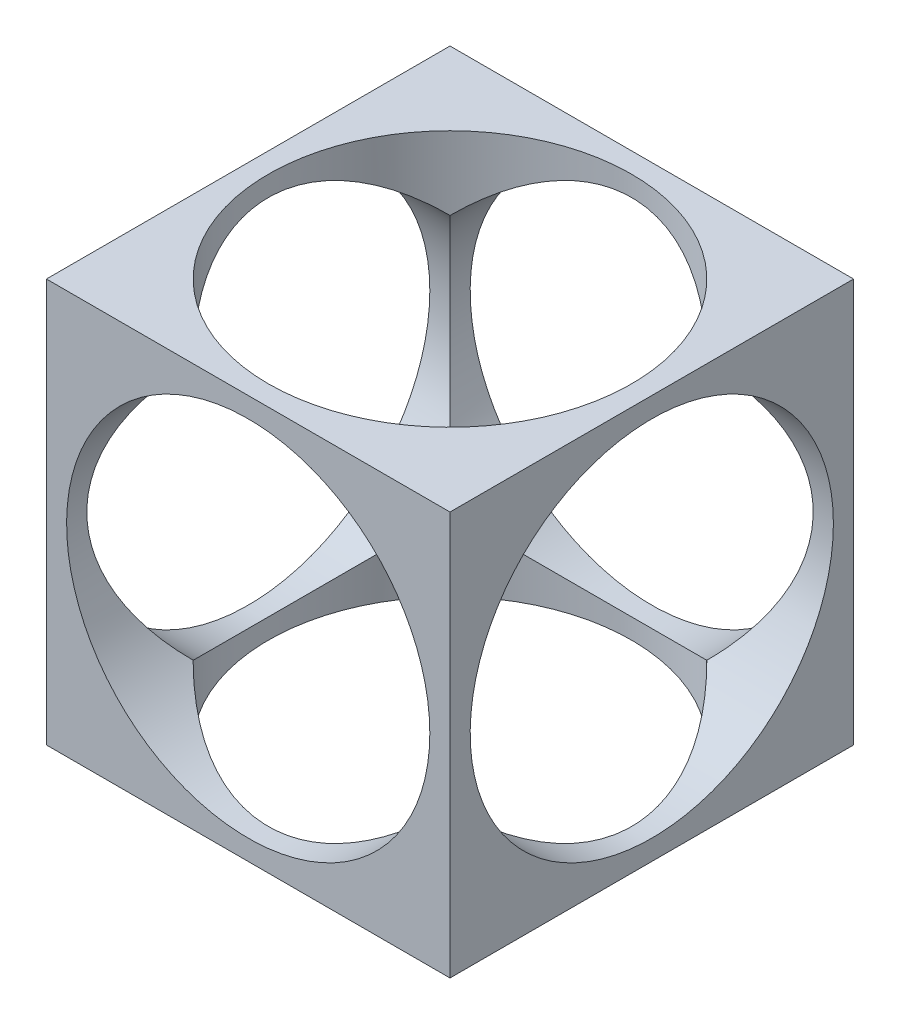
from build123d import *

# Parameters (mm, degrees)
SKETCH1_W          = 100
SKETCH1_H          = 100
EXTRUDE1_DEPTH     = 100
SKETCH2_R          = 45
CUT_EXTRUDE1_DEPTH = 174.205080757
SKETCH4_R          = 45
CUT_EXTRUDE2_DEPTH = 174.205080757
SKETCH5_R          = 45
CUT_EXTRUDE3_DEPTH = 174.205080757


with BuildPart() as part:
    # Sketch1 → Extrude1 (new body)
    with BuildSketch(Plane.XY):
        with Locations((50, 50)):
            Rectangle(SKETCH1_W, SKETCH1_H)
    extrude(amount=EXTRUDE1_DEPTH)

    # Sketch2 → Cut-Extrude1 (cut, through all)
    with BuildSketch(Plane(origin=(0, 0, 0), x_dir=(0, 0, -1), z_dir=(1, 0, 0))):
        with Locations((-50, 50)):
            Circle(SKETCH2_R)
    extrude(amount=CUT_EXTRUDE1_DEPTH, mode=Mode.SUBTRACT)

    # Sketch4 → Cut-Extrude2 (cut, through all)
    with BuildSketch(Plane(origin=(100, 0, 0), x_dir=(1, 0, 0), z_dir=(0, 0, 1))):
        with Locations(Location((-50, 50, 0), (0, 0, 270))):
            Circle(SKETCH4_R)
    extrude(amount=CUT_EXTRUDE2_DEPTH, mode=Mode.SUBTRACT)

    # Sketch5 → Cut-Extrude3 (cut, through all)
    with BuildSketch(Plane(origin=(100, 0, 0), x_dir=(0, 0, -1), z_dir=(0, 1, 0))):
        with Locations(Location((-50, 50, 0), (0, 0, 45))):
            Circle(SKETCH5_R)
    extrude(amount=CUT_EXTRUDE3_DEPTH, mode=Mode.SUBTRACT)


solid = part.part
